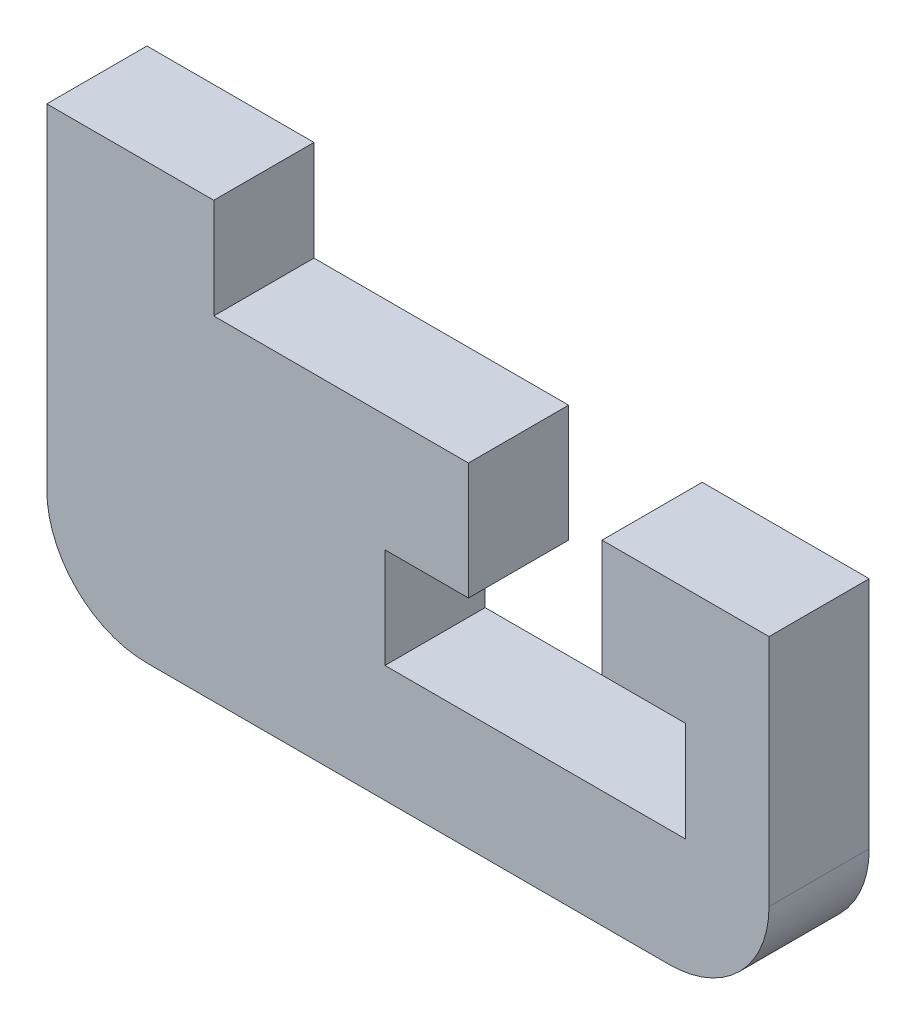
from build123d import *

# Parameters (mm, degrees)
SALIENTE_EXTRUIR1_DEPTH = 3


with BuildPart() as part:
    # Croquis1 → Saliente-Extruir1 (new body)
    with BuildSketch(Plane.XY):
        with BuildLine():
            Line((0, 22.001027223), (-5, 22.001027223))
            Line((-5, 22.001027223), (-5, 12.001027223))
            ThreePointArc((-5, 12.001027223), (-4.121320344, 9.87970688), (-2, 9.001027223))
            Line((-2, 9.001027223), (13.625, 9.001027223))
            ThreePointArc((13.625, 9.001027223), (15.746320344, 9.87970688), (16.625, 12.001027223))
            Line((16.625, 12.001027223), (16.625, 19.001027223))
            Line((16.625, 19.001027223), (11.625, 19.001027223))
            Line((11.625, 19.001027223), (11.625, 15.501027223))
            Line((11.625, 15.501027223), (14.125, 15.501027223))
            Line((14.125, 15.501027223), (14.125, 12.501027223))
            Line((14.125, 12.501027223), (5.125, 12.501027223))
            Line((5.125, 12.501027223), (5.125, 15.501027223))
            Line((5.125, 15.501027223), (7.625, 15.501027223))
            Line((7.625, 15.501027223), (7.625, 19.001027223))
            Line((7.625, 19.001027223), (0, 19.001027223))
            Line((0, 19.001027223), (0, 22.001027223))
        make_face()
    extrude(amount=SALIENTE_EXTRUIR1_DEPTH)


solid = part.part
